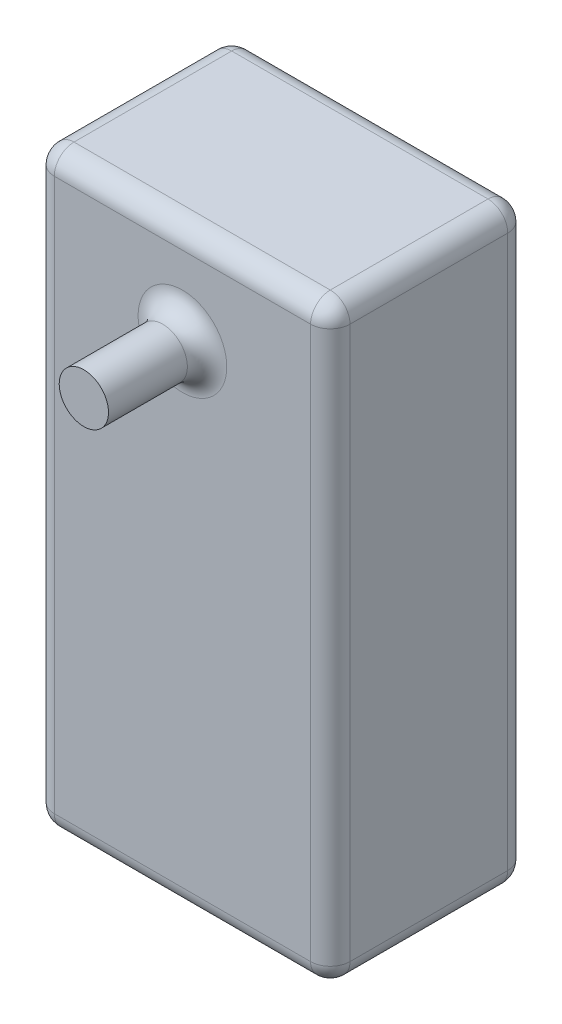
from build123d import *

# Parameters (mm, degrees)
ESQUISSE1_W        = 30
ESQUISSE1_H        = 60
BOSS_EXTRU_1_DEPTH = 20
ESQUISSE2_R        = 2.5
BOSS_EXTRU_2_DEPTH = 10
CONG_2_R           = 2


with BuildPart() as part:
    # Esquisse1 → Boss.-Extru.1 (new body)
    with BuildSketch(Plane.XY):
        with Locations((15, 30)):
            Rectangle(ESQUISSE1_W, ESQUISSE1_H)
    extrude(amount=BOSS_EXTRU_1_DEPTH)

    # Esquisse2 → Boss.-Extru.2 (add)
    with BuildSketch(Plane.XY.offset(20)):
        with Locations(Location((15, 50, 0), (0, 0, 180))):
            Circle(ESQUISSE2_R)
    extrude(amount=BOSS_EXTRU_2_DEPTH)

    # Cong_2
    cong_2_edges = [part.edges().sort_by_distance(p)[0] for p in [
        (30, 30, 20),
        (17.5, 50, 20),
        (15, 60, 20),
        (0, 30, 20),
        (15, 60, 0),
        (30, 30, 0),
        (15, 0, 0),
        (0, 30, 0),
        (0, 60, 10),
        (30, 60, 10),
        (30, 0, 10),
        (0, 0, 10),
        (15, 0, 20),
    ]]
    fillet(cong_2_edges, radius=CONG_2_R)


solid = part.part
